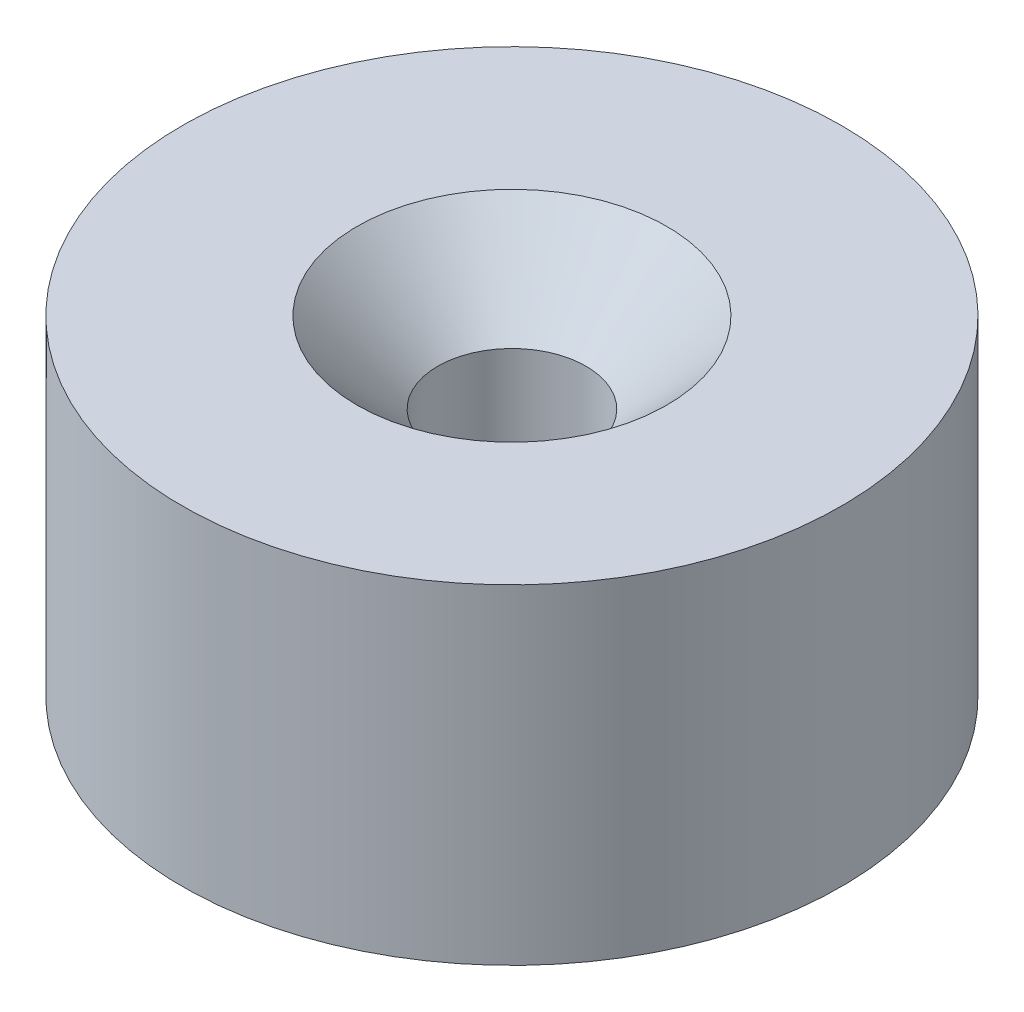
from build123d import *

# Parameters (mm, degrees)
CSK_FOR_M4_COUNTERSUNK_FLAT_HEAD_SCREW1_D           = 4.5
CSK_FOR_M4_COUNTERSUNK_FLAT_HEAD_SCREW1_CSINK_D     = 9.4
CSK_FOR_M4_COUNTERSUNK_FLAT_HEAD_SCREW1_CSINK_ANGLE = 90


with BuildPart() as part:
    # Sketch1 → Revolve1 (revolve)
    with BuildSketch(Plane(origin=(0, 0, 0), x_dir=(0, 0, -1), z_dir=(1, 0, 0))):
        Polygon((0, 0), (0, 14.5), (10, 14.5), (10, 4.5), (3, 4.5), (3, 0), align=None)
    revolve(axis=Axis((0, 0, 0), (0, 1, 0)))

    # CSK for M4 Countersunk Flat Head Screw1 (through all)
    with Locations(Plane.ZX.offset(14.5)):
        with Locations((0, 0)):
            CounterSinkHole(CSK_FOR_M4_COUNTERSUNK_FLAT_HEAD_SCREW1_D / 2, CSK_FOR_M4_COUNTERSUNK_FLAT_HEAD_SCREW1_CSINK_D / 2, counter_sink_angle=CSK_FOR_M4_COUNTERSUNK_FLAT_HEAD_SCREW1_CSINK_ANGLE)


solid = part.part
